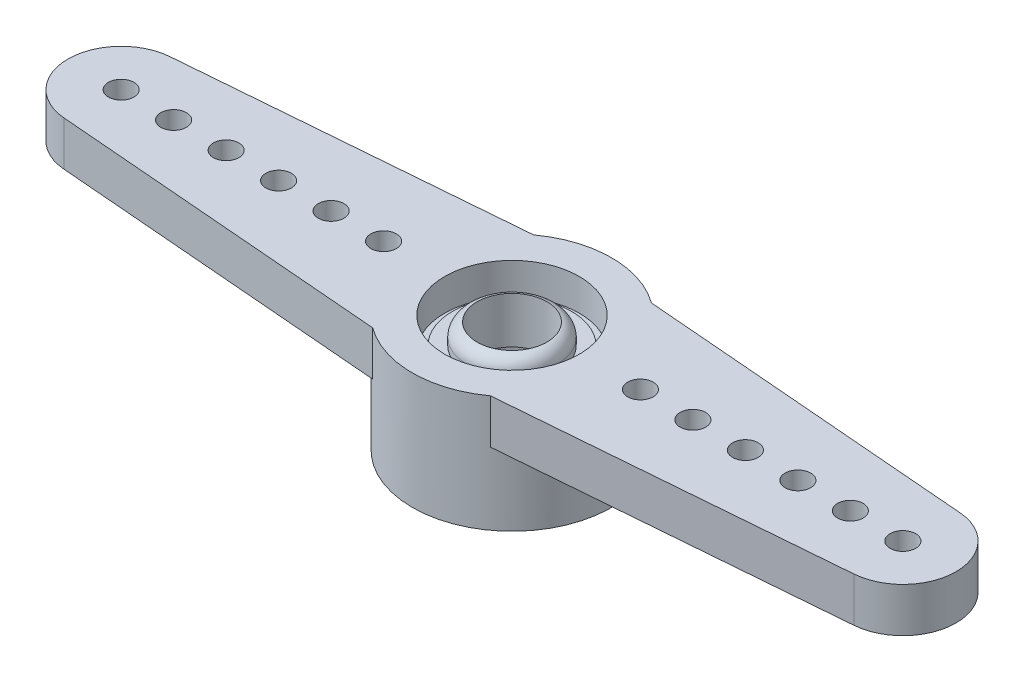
ISO-10303-21;
HEADER;
FILE_DESCRIPTION(('STEP AP214'),'2;1');
FILE_NAME('part.step','',(''),(''),'','','');
FILE_SCHEMA(('AUTOMOTIVE_DESIGN { 1 0 10303 214 1 1 1 1 }'));
ENDSEC;
DATA;
#1=APPLICATION_CONTEXT('core data for automotive mechanical design processes');
#2=APPLICATION_PROTOCOL_DEFINITION('international standard','automotive_design',2000,#1);
#3=PRODUCT_CONTEXT('',#1,'mechanical');
#4=PRODUCT('Part','Part','',(#3));
#5=PRODUCT_RELATED_PRODUCT_CATEGORY('part','',(#4));
#6=PRODUCT_DEFINITION_FORMATION('','',#4);
#7=PRODUCT_DEFINITION_CONTEXT('part definition',#1,'design');
#8=PRODUCT_DEFINITION('design','',#6,#7);
#9=PRODUCT_DEFINITION_SHAPE('','',#8);
#10=(LENGTH_UNIT() NAMED_UNIT(*) SI_UNIT(.MILLI.,.METRE.));
#11=(NAMED_UNIT(*) PLANE_ANGLE_UNIT() SI_UNIT($,.RADIAN.));
#12=(NAMED_UNIT(*) SI_UNIT($,.STERADIAN.) SOLID_ANGLE_UNIT());
#13=UNCERTAINTY_MEASURE_WITH_UNIT(LENGTH_MEASURE(1.E-05),#10,'distance_accuracy_value','');
#14=(GEOMETRIC_REPRESENTATION_CONTEXT(3) GLOBAL_UNCERTAINTY_ASSIGNED_CONTEXT((#13)) GLOBAL_UNIT_ASSIGNED_CONTEXT((#10,
#11,#12)) REPRESENTATION_CONTEXT('',''));
#15=CARTESIAN_POINT('',(0.,0.,0.));
#16=DIRECTION('',(0.,0.,1.));
#17=DIRECTION('',(1.,0.,0.));
#18=AXIS2_PLACEMENT_3D('',#15,#16,#17);
#19=CARTESIAN_POINT('',(0.,0.,0.));
#20=DIRECTION('',(0.,1.,0.));
#21=DIRECTION('',(0.,0.,1.));
#22=AXIS2_PLACEMENT_3D('',#19,#20,#21);
#23=PLANE('',#22);
#24=CARTESIAN_POINT('',(10.3759,0.,0.));
#25=DIRECTION('',(0.,1.,0.));
#26=DIRECTION('',(0.,0.,1.));
#27=AXIS2_PLACEMENT_3D('',#24,#25,#26);
#28=CIRCLE('',#27,0.46355);
#29=CARTESIAN_POINT('',(10.3759,0.,0.46355));
#30=VERTEX_POINT('',#29);
#31=EDGE_CURVE('E268',#30,#30,#28,.F.);
#32=ORIENTED_EDGE('',*,*,#31,.F.);
#33=EDGE_LOOP('',(#32));
#34=FACE_BOUND('',#33,.T.);
#35=CARTESIAN_POINT('',(6.5659,0.,0.));
#36=DIRECTION('',(0.,1.,0.));
#37=DIRECTION('',(0.,0.,1.));
#38=AXIS2_PLACEMENT_3D('',#35,#36,#37);
#39=CIRCLE('',#38,0.46355);
#40=CARTESIAN_POINT('',(6.5659,0.,0.46355));
#41=VERTEX_POINT('',#40);
#42=EDGE_CURVE('E282',#41,#41,#39,.F.);
#43=ORIENTED_EDGE('',*,*,#42,.F.);
#44=EDGE_LOOP('',(#43));
#45=FACE_BOUND('',#44,.T.);
#46=CARTESIAN_POINT('',(14.1859,0.,0.));
#47=DIRECTION('',(0.,1.,0.));
#48=DIRECTION('',(0.,0.,1.));
#49=AXIS2_PLACEMENT_3D('',#46,#47,#48);
#50=CIRCLE('',#49,0.46355);
#51=CARTESIAN_POINT('',(14.1859,0.,0.463550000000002));
#52=VERTEX_POINT('',#51);
#53=EDGE_CURVE('E292',#52,#52,#50,.F.);
#54=ORIENTED_EDGE('',*,*,#53,.F.);
#55=EDGE_LOOP('',(#54));
#56=FACE_BOUND('',#55,.T.);
#57=DIRECTION('',(0.996680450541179,0.,-0.0814130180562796));
#58=VECTOR('',#57,1.);
#59=CARTESIAN_POINT('',(14.3430596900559,0.,1.92399194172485));
#60=LINE('',#59,#58);
#61=CARTESIAN_POINT('',(2.1374141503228,0.,2.92099999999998));
#62=VERTEX_POINT('',#61);
#63=CARTESIAN_POINT('',(14.3430596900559,0.,1.92399194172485));
#64=VERTEX_POINT('',#63);
#65=EDGE_CURVE('E122',#62,#64,#60,.T.);
#66=ORIENTED_EDGE('',*,*,#65,.F.);
#67=CARTESIAN_POINT('',(0.,0.,0.));
#68=DIRECTION('',(0.,1.,0.));
#69=DIRECTION('',(0.,0.,1.));
#70=AXIS2_PLACEMENT_3D('',#67,#68,#69);
#71=CIRCLE('',#70,3.6195);
#72=CARTESIAN_POINT('',(2.1374141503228,0.,-2.92099999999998));
#73=VERTEX_POINT('',#72);
#74=EDGE_CURVE('E42',#62,#73,#71,.T.);
#75=ORIENTED_EDGE('',*,*,#74,.T.);
#76=DIRECTION('',(-0.996680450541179,0.,-0.0814130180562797));
#77=VECTOR('',#76,1.);
#78=CARTESIAN_POINT('',(14.3430596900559,0.,-1.92399194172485));
#79=LINE('',#78,#77);
#80=CARTESIAN_POINT('',(14.3430596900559,0.,-1.92399194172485));
#81=VERTEX_POINT('',#80);
#82=EDGE_CURVE('E127',#81,#73,#79,.T.);
#83=ORIENTED_EDGE('',*,*,#82,.F.);
#84=CARTESIAN_POINT('',(14.1859,0.,0.));
#85=DIRECTION('',(0.,1.,0.));
#86=DIRECTION('',(0.,0.,1.));
#87=AXIS2_PLACEMENT_3D('',#84,#85,#86);
#88=CIRCLE('',#87,1.93040000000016);
#89=EDGE_CURVE('E124',#64,#81,#88,.T.);
#90=ORIENTED_EDGE('',*,*,#89,.F.);
#91=EDGE_LOOP('',(#66,#75,#83,#90));
#92=FACE_BOUND('',#91,.T.);
#93=CARTESIAN_POINT('',(4.6609,0.,0.));
#94=DIRECTION('',(0.,1.,0.));
#95=DIRECTION('',(0.,0.,1.));
#96=AXIS2_PLACEMENT_3D('',#93,#94,#95);
#97=CIRCLE('',#96,0.46355);
#98=CARTESIAN_POINT('',(4.6609,0.,0.46355));
#99=VERTEX_POINT('',#98);
#100=EDGE_CURVE('E255',#99,#99,#97,.F.);
#101=ORIENTED_EDGE('',*,*,#100,.F.);
#102=EDGE_LOOP('',(#101));
#103=FACE_BOUND('',#102,.T.);
#104=CARTESIAN_POINT('',(8.4709,0.,0.));
#105=DIRECTION('',(0.,1.,0.));
#106=DIRECTION('',(0.,0.,1.));
#107=AXIS2_PLACEMENT_3D('',#104,#105,#106);
#108=CIRCLE('',#107,0.46355);
#109=CARTESIAN_POINT('',(8.4709,0.,0.46355));
#110=VERTEX_POINT('',#109);
#111=EDGE_CURVE('E259',#110,#110,#108,.F.);
#112=ORIENTED_EDGE('',*,*,#111,.F.);
#113=EDGE_LOOP('',(#112));
#114=FACE_BOUND('',#113,.T.);
#115=CARTESIAN_POINT('',(12.2809,0.,0.));
#116=DIRECTION('',(0.,1.,0.));
#117=DIRECTION('',(0.,0.,1.));
#118=AXIS2_PLACEMENT_3D('',#115,#116,#117);
#119=CIRCLE('',#118,0.46355);
#120=CARTESIAN_POINT('',(12.2809,0.,0.46355));
#121=VERTEX_POINT('',#120);
#122=EDGE_CURVE('E262',#121,#121,#119,.F.);
#123=ORIENTED_EDGE('',*,*,#122,.F.);
#124=EDGE_LOOP('',(#123));
#125=FACE_BOUND('',#124,.T.);
#126=ADVANCED_FACE('F32',(#34,#45,#56,#92,#103,#114,#125),#23,.F.);
#127=CARTESIAN_POINT('',(0.,1.6129,0.));
#128=DIRECTION('',(0.,1.,0.));
#129=DIRECTION('',(0.,0.,1.));
#130=AXIS2_PLACEMENT_3D('',#127,#128,#129);
#131=PLANE('',#130);
#132=CARTESIAN_POINT('',(10.3759,1.6129,0.));
#133=DIRECTION('',(0.,-1.,0.));
#134=DIRECTION('',(0.,0.,1.));
#135=AXIS2_PLACEMENT_3D('',#132,#133,#134);
#136=CIRCLE('',#135,0.46355);
#137=CARTESIAN_POINT('',(10.3759,1.6129,0.46355));
#138=VERTEX_POINT('',#137);
#139=EDGE_CURVE('E264',#138,#138,#136,.T.);
#140=ORIENTED_EDGE('',*,*,#139,.T.);
#141=EDGE_LOOP('',(#140));
#142=FACE_BOUND('',#141,.T.);
#143=CARTESIAN_POINT('',(6.5659,1.6129,0.));
#144=DIRECTION('',(0.,-1.,0.));
#145=DIRECTION('',(0.,0.,1.));
#146=AXIS2_PLACEMENT_3D('',#143,#144,#145);
#147=CIRCLE('',#146,0.46355);
#148=CARTESIAN_POINT('',(6.5659,1.6129,0.46355));
#149=VERTEX_POINT('',#148);
#150=EDGE_CURVE('E279',#149,#149,#147,.T.);
#151=ORIENTED_EDGE('',*,*,#150,.T.);
#152=EDGE_LOOP('',(#151));
#153=FACE_BOUND('',#152,.T.);
#154=CARTESIAN_POINT('',(14.1859,1.6129,0.));
#155=DIRECTION('',(0.,-1.,0.));
#156=DIRECTION('',(0.,0.,1.));
#157=AXIS2_PLACEMENT_3D('',#154,#155,#156);
#158=CIRCLE('',#157,0.46355);
#159=CARTESIAN_POINT('',(14.1859,1.6129,0.463550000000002));
#160=VERTEX_POINT('',#159);
#161=EDGE_CURVE('E289',#160,#160,#158,.T.);
#162=ORIENTED_EDGE('',*,*,#161,.T.);
#163=EDGE_LOOP('',(#162));
#164=FACE_BOUND('',#163,.T.);
#165=CARTESIAN_POINT('',(0.,1.6129,0.));
#166=DIRECTION('',(0.,1.,0.));
#167=DIRECTION('',(0.,0.,1.));
#168=AXIS2_PLACEMENT_3D('',#165,#166,#167);
#169=CIRCLE('',#168,2.44475);
#170=CARTESIAN_POINT('',(0.,1.6129,2.44475));
#171=VERTEX_POINT('',#170);
#172=EDGE_CURVE('E180',#171,#171,#169,.T.);
#173=ORIENTED_EDGE('',*,*,#172,.F.);
#174=EDGE_LOOP('',(#173));
#175=FACE_BOUND('',#174,.T.);
#176=CARTESIAN_POINT('',(-12.2809,1.6129,0.));
#177=DIRECTION('',(0.,1.,0.));
#178=DIRECTION('',(0.,0.,1.));
#179=AXIS2_PLACEMENT_3D('',#176,#177,#178);
#180=CIRCLE('',#179,0.46355);
#181=CARTESIAN_POINT('',(-12.2809,1.6129,0.46355));
#182=VERTEX_POINT('',#181);
#183=EDGE_CURVE('E177',#182,#182,#180,.T.);
#184=ORIENTED_EDGE('',*,*,#183,.F.);
#185=EDGE_LOOP('',(#184));
#186=FACE_BOUND('',#185,.T.);
#187=CARTESIAN_POINT('',(-10.3759,1.6129,0.));
#188=DIRECTION('',(0.,1.,0.));
#189=DIRECTION('',(0.,0.,1.));
#190=AXIS2_PLACEMENT_3D('',#187,#188,#189);
#191=CIRCLE('',#190,0.46355);
#192=CARTESIAN_POINT('',(-10.3759,1.6129,0.46355));
#193=VERTEX_POINT('',#192);
#194=EDGE_CURVE('E173',#193,#193,#191,.T.);
#195=ORIENTED_EDGE('',*,*,#194,.F.);
#196=EDGE_LOOP('',(#195));
#197=FACE_BOUND('',#196,.T.);
#198=CARTESIAN_POINT('',(-8.4709,1.6129,0.));
#199=DIRECTION('',(0.,1.,0.));
#200=DIRECTION('',(0.,0.,1.));
#201=AXIS2_PLACEMENT_3D('',#198,#199,#200);
#202=CIRCLE('',#201,0.46355);
#203=CARTESIAN_POINT('',(-8.4709,1.6129,0.46355));
#204=VERTEX_POINT('',#203);
#205=EDGE_CURVE('E169',#204,#204,#202,.T.);
#206=ORIENTED_EDGE('',*,*,#205,.F.);
#207=EDGE_LOOP('',(#206));
#208=FACE_BOUND('',#207,.T.);
#209=CARTESIAN_POINT('',(-6.5659,1.6129,0.));
#210=DIRECTION('',(0.,1.,0.));
#211=DIRECTION('',(0.,0.,1.));
#212=AXIS2_PLACEMENT_3D('',#209,#210,#211);
#213=CIRCLE('',#212,0.46355);
#214=CARTESIAN_POINT('',(-6.5659,1.6129,0.46355));
#215=VERTEX_POINT('',#214);
#216=EDGE_CURVE('E165',#215,#215,#213,.T.);
#217=ORIENTED_EDGE('',*,*,#216,.F.);
#218=EDGE_LOOP('',(#217));
#219=FACE_BOUND('',#218,.T.);
#220=CARTESIAN_POINT('',(-4.6609,1.6129,0.));
#221=DIRECTION('',(0.,1.,0.));
#222=DIRECTION('',(0.,0.,1.));
#223=AXIS2_PLACEMENT_3D('',#220,#221,#222);
#224=CIRCLE('',#223,0.46355);
#225=CARTESIAN_POINT('',(-4.6609,1.6129,0.46355));
#226=VERTEX_POINT('',#225);
#227=EDGE_CURVE('E161',#226,#226,#224,.T.);
#228=ORIENTED_EDGE('',*,*,#227,.F.);
#229=EDGE_LOOP('',(#228));
#230=FACE_BOUND('',#229,.T.);
#231=CARTESIAN_POINT('',(-14.1859,1.6129,0.));
#232=DIRECTION('',(0.,1.,0.));
#233=DIRECTION('',(0.,0.,1.));
#234=AXIS2_PLACEMENT_3D('',#231,#232,#233);
#235=CIRCLE('',#234,0.46355);
#236=CARTESIAN_POINT('',(-14.1859,1.6129,0.463550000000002));
#237=VERTEX_POINT('',#236);
#238=EDGE_CURVE('E157',#237,#237,#235,.T.);
#239=ORIENTED_EDGE('',*,*,#238,.F.);
#240=EDGE_LOOP('',(#239));
#241=FACE_BOUND('',#240,.T.);
#242=DIRECTION('',(0.996680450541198,0.,0.0814130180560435));
#243=VECTOR('',#242,1.);
#244=CARTESIAN_POINT('',(-14.3430596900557,1.6129,1.92399194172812));
#245=LINE('',#244,#243);
#246=CARTESIAN_POINT('',(-14.3430596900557,1.6129,1.92399194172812));
#247=VERTEX_POINT('',#246);
#248=CARTESIAN_POINT('',(-2.13741415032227,1.6129,2.92100000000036));
#249=VERTEX_POINT('',#248);
#250=EDGE_CURVE('E50',#247,#249,#245,.T.);
#251=ORIENTED_EDGE('',*,*,#250,.T.);
#252=CARTESIAN_POINT('',(0.,1.6129,0.));
#253=DIRECTION('',(0.,1.,0.));
#254=DIRECTION('',(0.,0.,1.));
#255=AXIS2_PLACEMENT_3D('',#252,#253,#254);
#256=CIRCLE('',#255,3.6195);
#257=CARTESIAN_POINT('',(2.1374141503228,1.6129,2.92099999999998));
#258=VERTEX_POINT('',#257);
#259=EDGE_CURVE('E135',#249,#258,#256,.T.);
#260=ORIENTED_EDGE('',*,*,#259,.T.);
#261=DIRECTION('',(0.996680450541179,0.,-0.0814130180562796));
#262=VECTOR('',#261,1.);
#263=CARTESIAN_POINT('',(14.3430596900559,1.6129,1.92399194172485));
#264=LINE('',#263,#262);
#265=CARTESIAN_POINT('',(14.3430596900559,1.6129,1.92399194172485));
#266=VERTEX_POINT('',#265);
#267=EDGE_CURVE('E87',#258,#266,#264,.T.);
#268=ORIENTED_EDGE('',*,*,#267,.T.);
#269=CARTESIAN_POINT('',(14.1859,1.6129,0.));
#270=DIRECTION('',(0.,1.,0.));
#271=DIRECTION('',(0.,0.,1.));
#272=AXIS2_PLACEMENT_3D('',#269,#270,#271);
#273=CIRCLE('',#272,1.93040000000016);
#274=CARTESIAN_POINT('',(14.3430596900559,1.6129,-1.92399194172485));
#275=VERTEX_POINT('',#274);
#276=EDGE_CURVE('E217',#266,#275,#273,.T.);
#277=ORIENTED_EDGE('',*,*,#276,.T.);
#278=DIRECTION('',(-0.996680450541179,0.,-0.0814130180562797));
#279=VECTOR('',#278,1.);
#280=CARTESIAN_POINT('',(14.3430596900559,1.6129,-1.92399194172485));
#281=LINE('',#280,#279);
#282=CARTESIAN_POINT('',(2.1374141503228,1.6129,-2.92099999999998));
#283=VERTEX_POINT('',#282);
#284=EDGE_CURVE('E219',#275,#283,#281,.T.);
#285=ORIENTED_EDGE('',*,*,#284,.T.);
#286=CARTESIAN_POINT('',(0.,1.6129,0.));
#287=DIRECTION('',(0.,1.,0.));
#288=DIRECTION('',(0.,0.,1.));
#289=AXIS2_PLACEMENT_3D('',#286,#287,#288);
#290=CIRCLE('',#289,3.6195);
#291=CARTESIAN_POINT('',(-2.13741415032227,1.6129,-2.92100000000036));
#292=VERTEX_POINT('',#291);
#293=EDGE_CURVE('E108',#283,#292,#290,.T.);
#294=ORIENTED_EDGE('',*,*,#293,.T.);
#295=DIRECTION('',(-0.996680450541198,0.,0.0814130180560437));
#296=VECTOR('',#295,1.);
#297=CARTESIAN_POINT('',(-14.3430596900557,1.6129,-1.92399194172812));
#298=LINE('',#297,#296);
#299=CARTESIAN_POINT('',(-14.3430596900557,1.6129,-1.92399194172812));
#300=VERTEX_POINT('',#299);
#301=EDGE_CURVE('E102',#292,#300,#298,.T.);
#302=ORIENTED_EDGE('',*,*,#301,.T.);
#303=CARTESIAN_POINT('',(-14.1859,1.6129,0.));
#304=DIRECTION('',(0.,1.,0.));
#305=DIRECTION('',(0.,0.,1.));
#306=AXIS2_PLACEMENT_3D('',#303,#304,#305);
#307=CIRCLE('',#306,1.9304000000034);
#308=EDGE_CURVE('E106',#300,#247,#307,.T.);
#309=ORIENTED_EDGE('',*,*,#308,.T.);
#310=EDGE_LOOP('',(#251,#260,#268,#277,#285,#294,#302,#309));
#311=FACE_BOUND('',#310,.T.);
#312=CARTESIAN_POINT('',(4.6609,1.6129,0.));
#313=DIRECTION('',(0.,-1.,0.));
#314=DIRECTION('',(0.,0.,1.));
#315=AXIS2_PLACEMENT_3D('',#312,#313,#314);
#316=CIRCLE('',#315,0.46355);
#317=CARTESIAN_POINT('',(4.6609,1.6129,0.46355));
#318=VERTEX_POINT('',#317);
#319=EDGE_CURVE('E285',#318,#318,#316,.T.);
#320=ORIENTED_EDGE('',*,*,#319,.T.);
#321=EDGE_LOOP('',(#320));
#322=FACE_BOUND('',#321,.T.);
#323=CARTESIAN_POINT('',(8.4709,1.6129,0.));
#324=DIRECTION('',(0.,-1.,0.));
#325=DIRECTION('',(0.,0.,1.));
#326=AXIS2_PLACEMENT_3D('',#323,#324,#325);
#327=CIRCLE('',#326,0.46355);
#328=CARTESIAN_POINT('',(8.4709,1.6129,0.46355));
#329=VERTEX_POINT('',#328);
#330=EDGE_CURVE('E275',#329,#329,#327,.T.);
#331=ORIENTED_EDGE('',*,*,#330,.T.);
#332=EDGE_LOOP('',(#331));
#333=FACE_BOUND('',#332,.T.);
#334=CARTESIAN_POINT('',(12.2809,1.6129,0.));
#335=DIRECTION('',(0.,-1.,0.));
#336=DIRECTION('',(0.,0.,1.));
#337=AXIS2_PLACEMENT_3D('',#334,#335,#336);
#338=CIRCLE('',#337,0.46355);
#339=CARTESIAN_POINT('',(12.2809,1.6129,0.46355));
#340=VERTEX_POINT('',#339);
#341=EDGE_CURVE('E265',#340,#340,#338,.T.);
#342=ORIENTED_EDGE('',*,*,#341,.T.);
#343=EDGE_LOOP('',(#342));
#344=FACE_BOUND('',#343,.T.);
#345=ADVANCED_FACE('F103',(#142,#153,#164,#175,#186,#197,#208,#219,#230,#241,#311,#322,#333,
#344),#131,.T.);
#346=CARTESIAN_POINT('',(0.,0.9144,0.));
#347=DIRECTION('',(0.,1.,0.));
#348=DIRECTION('',(0.,0.,1.));
#349=AXIS2_PLACEMENT_3D('',#346,#347,#348);
#350=TOROIDAL_SURFACE('',#349,1.143,0.508);
#351=CARTESIAN_POINT('',(0.,0.9144,0.));
#352=DIRECTION('',(0.,1.,0.));
#353=DIRECTION('',(0.,0.,1.));
#354=AXIS2_PLACEMENT_3D('',#351,#352,#353);
#355=CIRCLE('',#354,1.651);
#356=CARTESIAN_POINT('',(0.,0.9144,-1.651));
#357=VERTEX_POINT('',#356);
#358=EDGE_CURVE('E11',#357,#357,#355,.F.);
#359=ORIENTED_EDGE('',*,*,#358,.F.);
#360=EDGE_LOOP('',(#359));
#361=FACE_BOUND('',#360,.T.);
#362=CARTESIAN_POINT('',(0.,1.40626888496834,0.));
#363=DIRECTION('',(0.,-1.,0.));
#364=DIRECTION('',(0.,0.,-1.));
#365=AXIS2_PLACEMENT_3D('',#362,#363,#364);
#366=CIRCLE('',#365,1.27);
#367=CARTESIAN_POINT('',(0.,1.40626888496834,-1.27));
#368=VERTEX_POINT('',#367);
#369=EDGE_CURVE('E36',#368,#368,#366,.T.);
#370=ORIENTED_EDGE('',*,*,#369,.T.);
#371=EDGE_LOOP('',(#370));
#372=FACE_BOUND('',#371,.T.);
#373=ADVANCED_FACE('F34',(#361,#372),#350,.T.);
#374=CARTESIAN_POINT('',(0.,0.6604,0.));
#375=DIRECTION('',(0.,1.,0.));
#376=DIRECTION('',(0.,0.,1.));
#377=AXIS2_PLACEMENT_3D('',#374,#375,#376);
#378=PLANE('',#377);
#379=CARTESIAN_POINT('',(0.,0.6604,0.));
#380=DIRECTION('',(0.,1.,0.));
#381=DIRECTION('',(0.,0.,1.));
#382=AXIS2_PLACEMENT_3D('',#379,#380,#381);
#383=CIRCLE('',#382,2.159);
#384=CARTESIAN_POINT('',(0.,0.6604,2.159));
#385=VERTEX_POINT('',#384);
#386=EDGE_CURVE('E193',#385,#385,#383,.T.);
#387=ORIENTED_EDGE('',*,*,#386,.T.);
#388=EDGE_LOOP('',(#387));
#389=FACE_BOUND('',#388,.T.);
#390=CARTESIAN_POINT('',(0.,0.6604,0.));
#391=DIRECTION('',(0.,1.,0.));
#392=DIRECTION('',(0.,0.,1.));
#393=AXIS2_PLACEMENT_3D('',#390,#391,#392);
#394=CIRCLE('',#393,1.651);
#395=CARTESIAN_POINT('',(0.,0.6604,-1.651));
#396=VERTEX_POINT('',#395);
#397=EDGE_CURVE('E295',#396,#396,#394,.T.);
#398=ORIENTED_EDGE('',*,*,#397,.F.);
#399=EDGE_LOOP('',(#398));
#400=FACE_BOUND('',#399,.T.);
#401=ADVANCED_FACE('F308',(#389,#400),#378,.T.);
#402=CARTESIAN_POINT('',(0.,0.4572,0.));
#403=DIRECTION('',(0.,1.,0.));
#404=DIRECTION('',(0.,0.,1.));
#405=AXIS2_PLACEMENT_3D('',#402,#403,#404);
#406=PLANE('',#405);
#407=CARTESIAN_POINT('',(0.,0.4572,0.));
#408=DIRECTION('',(0.,1.,0.));
#409=DIRECTION('',(0.,0.,1.));
#410=AXIS2_PLACEMENT_3D('',#407,#408,#409);
#411=CIRCLE('',#410,2.44475);
#412=CARTESIAN_POINT('',(0.,0.4572,2.44475));
#413=VERTEX_POINT('',#412);
#414=EDGE_CURVE('E185',#413,#413,#411,.T.);
#415=ORIENTED_EDGE('',*,*,#414,.T.);
#416=EDGE_LOOP('',(#415));
#417=FACE_BOUND('',#416,.T.);
#418=CARTESIAN_POINT('',(0.,0.4572,0.));
#419=DIRECTION('',(0.,1.,0.));
#420=DIRECTION('',(0.,0.,1.));
#421=AXIS2_PLACEMENT_3D('',#418,#419,#420);
#422=CIRCLE('',#421,2.159);
#423=CARTESIAN_POINT('',(0.,0.4572,2.159));
#424=VERTEX_POINT('',#423);
#425=EDGE_CURVE('E196',#424,#424,#422,.T.);
#426=ORIENTED_EDGE('',*,*,#425,.F.);
#427=EDGE_LOOP('',(#426));
#428=FACE_BOUND('',#427,.T.);
#429=ADVANCED_FACE('F305',(#417,#428),#406,.T.);
#430=CARTESIAN_POINT('',(0.,-2.6162,0.));
#431=DIRECTION('',(0.,1.,0.));
#432=DIRECTION('',(0.,0.,1.));
#433=AXIS2_PLACEMENT_3D('',#430,#431,#432);
#434=CYLINDRICAL_SURFACE('',#433,1.27);
#435=CARTESIAN_POINT('',(0.,-0.2794,0.));
#436=DIRECTION('',(0.,-1.,0.));
#437=DIRECTION('',(0.,0.,-1.));
#438=AXIS2_PLACEMENT_3D('',#435,#436,#437);
#439=CIRCLE('',#438,1.27);
#440=CARTESIAN_POINT('',(0.,-0.2794,-1.27));
#441=VERTEX_POINT('',#440);
#442=EDGE_CURVE('E178',#441,#441,#439,.F.);
#443=ORIENTED_EDGE('',*,*,#442,.F.);
#444=EDGE_LOOP('',(#443));
#445=FACE_BOUND('',#444,.T.);
#446=ORIENTED_EDGE('',*,*,#369,.F.);
#447=EDGE_LOOP('',(#446));
#448=FACE_BOUND('',#447,.T.);
#449=ADVANCED_FACE('F307',(#445,#448),#434,.F.);
#450=CARTESIAN_POINT('',(14.3430596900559,1.6129,1.92399194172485));
#451=DIRECTION('',(-0.0814130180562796,0.,-0.996680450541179));
#452=DIRECTION('',(-0.996680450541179,0.,0.0814130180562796));
#453=AXIS2_PLACEMENT_3D('',#450,#451,#452);
#454=PLANE('',#453);
#455=ORIENTED_EDGE('',*,*,#65,.T.);
#456=DIRECTION('',(0.,-1.,0.));
#457=VECTOR('',#456,1.);
#458=CARTESIAN_POINT('',(14.3430596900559,1.6129,1.92399194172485));
#459=LINE('',#458,#457);
#460=EDGE_CURVE('E146',#266,#64,#459,.T.);
#461=ORIENTED_EDGE('',*,*,#460,.F.);
#462=ORIENTED_EDGE('',*,*,#267,.F.);
#463=DIRECTION('',(0.,-1.,0.));
#464=VECTOR('',#463,1.);
#465=CARTESIAN_POINT('',(2.1374141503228,1.6129,2.92099999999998));
#466=LINE('',#465,#464);
#467=EDGE_CURVE('E149',#258,#62,#466,.T.);
#468=ORIENTED_EDGE('',*,*,#467,.T.);
#469=EDGE_LOOP('',(#455,#461,#462,#468));
#470=FACE_BOUND('',#469,.T.);
#471=ADVANCED_FACE('F241',(#470),#454,.F.);
#472=CARTESIAN_POINT('',(14.1859,1.6129,0.));
#473=DIRECTION('',(0.,-1.,0.));
#474=DIRECTION('',(0.,0.,-1.));
#475=AXIS2_PLACEMENT_3D('',#472,#473,#474);
#476=CYLINDRICAL_SURFACE('',#475,1.93040000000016);
#477=ORIENTED_EDGE('',*,*,#89,.T.);
#478=DIRECTION('',(0.,-1.,0.));
#479=VECTOR('',#478,1.);
#480=CARTESIAN_POINT('',(14.3430596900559,1.6129,-1.92399194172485));
#481=LINE('',#480,#479);
#482=EDGE_CURVE('E143',#275,#81,#481,.T.);
#483=ORIENTED_EDGE('',*,*,#482,.F.);
#484=ORIENTED_EDGE('',*,*,#276,.F.);
#485=ORIENTED_EDGE('',*,*,#460,.T.);
#486=EDGE_LOOP('',(#477,#483,#484,#485));
#487=FACE_BOUND('',#486,.T.);
#488=ADVANCED_FACE('F245',(#487),#476,.T.);
#489=CARTESIAN_POINT('',(14.3430596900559,1.6129,-1.92399194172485));
#490=DIRECTION('',(-0.0814130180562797,0.,0.996680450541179));
#491=DIRECTION('',(0.996680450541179,0.,0.0814130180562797));
#492=AXIS2_PLACEMENT_3D('',#489,#490,#491);
#493=PLANE('',#492);
#494=ORIENTED_EDGE('',*,*,#82,.T.);
#495=DIRECTION('',(0.,-1.,0.));
#496=VECTOR('',#495,1.);
#497=CARTESIAN_POINT('',(2.1374141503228,1.6129,-2.92099999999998));
#498=LINE('',#497,#496);
#499=EDGE_CURVE('E140',#283,#73,#498,.T.);
#500=ORIENTED_EDGE('',*,*,#499,.F.);
#501=ORIENTED_EDGE('',*,*,#284,.F.);
#502=ORIENTED_EDGE('',*,*,#482,.T.);
#503=EDGE_LOOP('',(#494,#500,#501,#502));
#504=FACE_BOUND('',#503,.T.);
#505=ADVANCED_FACE('F225',(#504),#493,.F.);
#506=CARTESIAN_POINT('',(0.,1.6129,0.));
#507=DIRECTION('',(0.,-1.,0.));
#508=DIRECTION('',(0.,0.,-1.));
#509=AXIS2_PLACEMENT_3D('',#506,#507,#508);
#510=CYLINDRICAL_SURFACE('',#509,3.6195);
#511=ORIENTED_EDGE('',*,*,#499,.T.);
#512=ORIENTED_EDGE('',*,*,#74,.F.);
#513=ORIENTED_EDGE('',*,*,#467,.F.);
#514=ORIENTED_EDGE('',*,*,#259,.F.);
#515=DIRECTION('',(0.,-1.,0.));
#516=VECTOR('',#515,1.);
#517=CARTESIAN_POINT('',(-2.13741415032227,1.6129,2.92100000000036));
#518=LINE('',#517,#516);
#519=CARTESIAN_POINT('',(-2.13741415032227,0.,2.92100000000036));
#520=VERTEX_POINT('',#519);
#521=EDGE_CURVE('E118',#249,#520,#518,.T.);
#522=ORIENTED_EDGE('',*,*,#521,.T.);
#523=CARTESIAN_POINT('',(-2.13741415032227,0.,-2.92100000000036));
#524=VERTEX_POINT('',#523);
#525=EDGE_CURVE('E151',#524,#520,#71,.T.);
#526=ORIENTED_EDGE('',*,*,#525,.F.);
#527=DIRECTION('',(0.,-1.,0.));
#528=VECTOR('',#527,1.);
#529=CARTESIAN_POINT('',(-2.13741415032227,1.6129,-2.92100000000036));
#530=LINE('',#529,#528);
#531=EDGE_CURVE('E113',#292,#524,#530,.T.);
#532=ORIENTED_EDGE('',*,*,#531,.F.);
#533=ORIENTED_EDGE('',*,*,#293,.F.);
#534=EDGE_LOOP('',(#511,#512,#513,#514,#522,#526,#532,#533));
#535=FACE_BOUND('',#534,.T.);
#536=CARTESIAN_POINT('',(0.,-2.6162,0.));
#537=DIRECTION('',(0.,1.,0.));
#538=DIRECTION('',(0.,0.,1.));
#539=AXIS2_PLACEMENT_3D('',#536,#537,#538);
#540=CIRCLE('',#539,3.6195);
#541=CARTESIAN_POINT('',(0.,-2.6162,3.6195));
#542=VERTEX_POINT('',#541);
#543=EDGE_CURVE('E125',#542,#542,#540,.T.);
#544=ORIENTED_EDGE('',*,*,#543,.T.);
#545=EDGE_LOOP('',(#544));
#546=FACE_BOUND('',#545,.T.);
#547=ADVANCED_FACE('F228',(#535,#546),#510,.T.);
#548=CARTESIAN_POINT('',(-14.3430596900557,1.6129,-1.92399194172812));
#549=DIRECTION('',(0.0814130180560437,0.,0.996680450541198));
#550=DIRECTION('',(0.996680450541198,0.,-0.0814130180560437));
#551=AXIS2_PLACEMENT_3D('',#548,#549,#550);
#552=PLANE('',#551);
#553=DIRECTION('',(-0.996680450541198,0.,0.0814130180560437));
#554=VECTOR('',#553,1.);
#555=CARTESIAN_POINT('',(-14.3430596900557,0.,-1.92399194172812));
#556=LINE('',#555,#554);
#557=CARTESIAN_POINT('',(-14.3430596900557,0.,-1.92399194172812));
#558=VERTEX_POINT('',#557);
#559=EDGE_CURVE('E71',#524,#558,#556,.T.);
#560=ORIENTED_EDGE('',*,*,#559,.T.);
#561=DIRECTION('',(0.,-1.,0.));
#562=VECTOR('',#561,1.);
#563=CARTESIAN_POINT('',(-14.3430596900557,1.6129,-1.92399194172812));
#564=LINE('',#563,#562);
#565=EDGE_CURVE('E111',#300,#558,#564,.T.);
#566=ORIENTED_EDGE('',*,*,#565,.F.);
#567=ORIENTED_EDGE('',*,*,#301,.F.);
#568=ORIENTED_EDGE('',*,*,#531,.T.);
#569=EDGE_LOOP('',(#560,#566,#567,#568));
#570=FACE_BOUND('',#569,.T.);
#571=ADVANCED_FACE('F112',(#570),#552,.F.);
#572=CARTESIAN_POINT('',(-14.1859,1.6129,0.));
#573=DIRECTION('',(0.,-1.,0.));
#574=DIRECTION('',(0.,0.,-1.));
#575=AXIS2_PLACEMENT_3D('',#572,#573,#574);
#576=CYLINDRICAL_SURFACE('',#575,1.9304000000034);
#577=CARTESIAN_POINT('',(-14.1859,0.,0.));
#578=DIRECTION('',(0.,1.,0.));
#579=DIRECTION('',(0.,0.,1.));
#580=AXIS2_PLACEMENT_3D('',#577,#578,#579);
#581=CIRCLE('',#580,1.9304000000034);
#582=CARTESIAN_POINT('',(-14.3430596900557,0.,1.92399194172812));
#583=VERTEX_POINT('',#582);
#584=EDGE_CURVE('E78',#558,#583,#581,.T.);
#585=ORIENTED_EDGE('',*,*,#584,.T.);
#586=DIRECTION('',(0.,-1.,0.));
#587=VECTOR('',#586,1.);
#588=CARTESIAN_POINT('',(-14.3430596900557,1.6129,1.92399194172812));
#589=LINE('',#588,#587);
#590=EDGE_CURVE('E114',#247,#583,#589,.T.);
#591=ORIENTED_EDGE('',*,*,#590,.F.);
#592=ORIENTED_EDGE('',*,*,#308,.F.);
#593=ORIENTED_EDGE('',*,*,#565,.T.);
#594=EDGE_LOOP('',(#585,#591,#592,#593));
#595=FACE_BOUND('',#594,.T.);
#596=ADVANCED_FACE('F116',(#595),#576,.T.);
#597=CARTESIAN_POINT('',(-14.3430596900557,1.6129,1.92399194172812));
#598=DIRECTION('',(0.0814130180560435,0.,-0.996680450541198));
#599=DIRECTION('',(-0.996680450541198,0.,-0.0814130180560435));
#600=AXIS2_PLACEMENT_3D('',#597,#598,#599);
#601=PLANE('',#600);
#602=DIRECTION('',(0.996680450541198,0.,0.0814130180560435));
#603=VECTOR('',#602,1.);
#604=CARTESIAN_POINT('',(-14.3430596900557,0.,1.92399194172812));
#605=LINE('',#604,#603);
#606=EDGE_CURVE('E132',#583,#520,#605,.T.);
#607=ORIENTED_EDGE('',*,*,#606,.T.);
#608=ORIENTED_EDGE('',*,*,#521,.F.);
#609=ORIENTED_EDGE('',*,*,#250,.F.);
#610=ORIENTED_EDGE('',*,*,#590,.T.);
#611=EDGE_LOOP('',(#607,#608,#609,#610));
#612=FACE_BOUND('',#611,.T.);
#613=ADVANCED_FACE('F237',(#612),#601,.F.);
#614=CARTESIAN_POINT('',(-12.2809,0.,0.));
#615=DIRECTION('',(0.,1.,0.));
#616=DIRECTION('',(0.,0.,1.));
#617=AXIS2_PLACEMENT_3D('',#614,#615,#616);
#618=CIRCLE('',#617,0.46355);
#619=CARTESIAN_POINT('',(-12.2809,0.,0.46355));
#620=VERTEX_POINT('',#619);
#621=EDGE_CURVE('E174',#620,#620,#618,.T.);
#622=ORIENTED_EDGE('',*,*,#621,.T.);
#623=EDGE_LOOP('',(#622));
#624=FACE_BOUND('',#623,.T.);
#625=CARTESIAN_POINT('',(-10.3759,0.,0.));
#626=DIRECTION('',(0.,1.,0.));
#627=DIRECTION('',(0.,0.,1.));
#628=AXIS2_PLACEMENT_3D('',#625,#626,#627);
#629=CIRCLE('',#628,0.46355);
#630=CARTESIAN_POINT('',(-10.3759,0.,0.46355));
#631=VERTEX_POINT('',#630);
#632=EDGE_CURVE('E170',#631,#631,#629,.T.);
#633=ORIENTED_EDGE('',*,*,#632,.T.);
#634=EDGE_LOOP('',(#633));
#635=FACE_BOUND('',#634,.T.);
#636=CARTESIAN_POINT('',(-8.4709,0.,0.));
#637=DIRECTION('',(0.,1.,0.));
#638=DIRECTION('',(0.,0.,1.));
#639=AXIS2_PLACEMENT_3D('',#636,#637,#638);
#640=CIRCLE('',#639,0.46355);
#641=CARTESIAN_POINT('',(-8.4709,0.,0.46355));
#642=VERTEX_POINT('',#641);
#643=EDGE_CURVE('E166',#642,#642,#640,.T.);
#644=ORIENTED_EDGE('',*,*,#643,.T.);
#645=EDGE_LOOP('',(#644));
#646=FACE_BOUND('',#645,.T.);
#647=CARTESIAN_POINT('',(-6.5659,0.,0.));
#648=DIRECTION('',(0.,1.,0.));
#649=DIRECTION('',(0.,0.,1.));
#650=AXIS2_PLACEMENT_3D('',#647,#648,#649);
#651=CIRCLE('',#650,0.46355);
#652=CARTESIAN_POINT('',(-6.5659,0.,0.46355));
#653=VERTEX_POINT('',#652);
#654=EDGE_CURVE('E162',#653,#653,#651,.T.);
#655=ORIENTED_EDGE('',*,*,#654,.T.);
#656=EDGE_LOOP('',(#655));
#657=FACE_BOUND('',#656,.T.);
#658=CARTESIAN_POINT('',(-4.6609,0.,0.));
#659=DIRECTION('',(0.,1.,0.));
#660=DIRECTION('',(0.,0.,1.));
#661=AXIS2_PLACEMENT_3D('',#658,#659,#660);
#662=CIRCLE('',#661,0.46355);
#663=CARTESIAN_POINT('',(-4.6609,0.,0.46355));
#664=VERTEX_POINT('',#663);
#665=EDGE_CURVE('E158',#664,#664,#662,.T.);
#666=ORIENTED_EDGE('',*,*,#665,.T.);
#667=EDGE_LOOP('',(#666));
#668=FACE_BOUND('',#667,.T.);
#669=CARTESIAN_POINT('',(-14.1859,0.,0.));
#670=DIRECTION('',(0.,1.,0.));
#671=DIRECTION('',(0.,0.,1.));
#672=AXIS2_PLACEMENT_3D('',#669,#670,#671);
#673=CIRCLE('',#672,0.46355);
#674=CARTESIAN_POINT('',(-14.1859,0.,0.463550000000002));
#675=VERTEX_POINT('',#674);
#676=EDGE_CURVE('E154',#675,#675,#673,.T.);
#677=ORIENTED_EDGE('',*,*,#676,.T.);
#678=EDGE_LOOP('',(#677));
#679=FACE_BOUND('',#678,.T.);
#680=ORIENTED_EDGE('',*,*,#559,.F.);
#681=ORIENTED_EDGE('',*,*,#525,.T.);
#682=ORIENTED_EDGE('',*,*,#606,.F.);
#683=ORIENTED_EDGE('',*,*,#584,.F.);
#684=EDGE_LOOP('',(#680,#681,#682,#683));
#685=FACE_BOUND('',#684,.T.);
#686=ADVANCED_FACE('F234',(#624,#635,#646,#657,#668,#679,#685),#23,.F.);
#687=CARTESIAN_POINT('',(0.,-2.6162,0.));
#688=DIRECTION('',(0.,1.,0.));
#689=DIRECTION('',(0.,0.,1.));
#690=AXIS2_PLACEMENT_3D('',#687,#688,#689);
#691=PLANE('',#690);
#692=CARTESIAN_POINT('',(0.,-2.6162,0.));
#693=DIRECTION('',(0.,-1.,0.));
#694=DIRECTION('',(0.,0.,-1.));
#695=AXIS2_PLACEMENT_3D('',#692,#693,#694);
#696=CIRCLE('',#695,2.286);
#697=CARTESIAN_POINT('',(0.,-2.6162,-2.286));
#698=VERTEX_POINT('',#697);
#699=EDGE_CURVE('E188',#698,#698,#696,.T.);
#700=ORIENTED_EDGE('',*,*,#699,.F.);
#701=EDGE_LOOP('',(#700));
#702=FACE_BOUND('',#701,.T.);
#703=ORIENTED_EDGE('',*,*,#543,.F.);
#704=EDGE_LOOP('',(#703));
#705=FACE_BOUND('',#704,.T.);
#706=ADVANCED_FACE('F350',(#702,#705),#691,.F.);
#707=CARTESIAN_POINT('',(-14.1859,-2.6162,0.));
#708=DIRECTION('',(0.,1.,0.));
#709=DIRECTION('',(0.,0.,1.));
#710=AXIS2_PLACEMENT_3D('',#707,#708,#709);
#711=CYLINDRICAL_SURFACE('',#710,0.46355);
#712=ORIENTED_EDGE('',*,*,#238,.T.);
#713=EDGE_LOOP('',(#712));
#714=FACE_BOUND('',#713,.T.);
#715=ORIENTED_EDGE('',*,*,#676,.F.);
#716=EDGE_LOOP('',(#715));
#717=FACE_BOUND('',#716,.T.);
#718=ADVANCED_FACE('F345',(#714,#717),#711,.F.);
#719=CARTESIAN_POINT('',(-4.6609,-2.6162,0.));
#720=DIRECTION('',(0.,1.,0.));
#721=DIRECTION('',(0.,0.,1.));
#722=AXIS2_PLACEMENT_3D('',#719,#720,#721);
#723=CYLINDRICAL_SURFACE('',#722,0.46355);
#724=ORIENTED_EDGE('',*,*,#227,.T.);
#725=EDGE_LOOP('',(#724));
#726=FACE_BOUND('',#725,.T.);
#727=ORIENTED_EDGE('',*,*,#665,.F.);
#728=EDGE_LOOP('',(#727));
#729=FACE_BOUND('',#728,.T.);
#730=ADVANCED_FACE('F342',(#726,#729),#723,.F.);
#731=CARTESIAN_POINT('',(-6.5659,-2.6162,0.));
#732=DIRECTION('',(0.,1.,0.));
#733=DIRECTION('',(0.,0.,1.));
#734=AXIS2_PLACEMENT_3D('',#731,#732,#733);
#735=CYLINDRICAL_SURFACE('',#734,0.46355);
#736=ORIENTED_EDGE('',*,*,#216,.T.);
#737=EDGE_LOOP('',(#736));
#738=FACE_BOUND('',#737,.T.);
#739=ORIENTED_EDGE('',*,*,#654,.F.);
#740=EDGE_LOOP('',(#739));
#741=FACE_BOUND('',#740,.T.);
#742=ADVANCED_FACE('F338',(#738,#741),#735,.F.);
#743=CARTESIAN_POINT('',(-8.4709,-2.6162,0.));
#744=DIRECTION('',(0.,1.,0.));
#745=DIRECTION('',(0.,0.,1.));
#746=AXIS2_PLACEMENT_3D('',#743,#744,#745);
#747=CYLINDRICAL_SURFACE('',#746,0.46355);
#748=ORIENTED_EDGE('',*,*,#205,.T.);
#749=EDGE_LOOP('',(#748));
#750=FACE_BOUND('',#749,.T.);
#751=ORIENTED_EDGE('',*,*,#643,.F.);
#752=EDGE_LOOP('',(#751));
#753=FACE_BOUND('',#752,.T.);
#754=ADVANCED_FACE('F334',(#750,#753),#747,.F.);
#755=CARTESIAN_POINT('',(-10.3759,-2.6162,0.));
#756=DIRECTION('',(0.,1.,0.));
#757=DIRECTION('',(0.,0.,1.));
#758=AXIS2_PLACEMENT_3D('',#755,#756,#757);
#759=CYLINDRICAL_SURFACE('',#758,0.46355);
#760=ORIENTED_EDGE('',*,*,#194,.T.);
#761=EDGE_LOOP('',(#760));
#762=FACE_BOUND('',#761,.T.);
#763=ORIENTED_EDGE('',*,*,#632,.F.);
#764=EDGE_LOOP('',(#763));
#765=FACE_BOUND('',#764,.T.);
#766=ADVANCED_FACE('F330',(#762,#765),#759,.F.);
#767=CARTESIAN_POINT('',(-12.2809,-2.6162,0.));
#768=DIRECTION('',(0.,1.,0.));
#769=DIRECTION('',(0.,0.,1.));
#770=AXIS2_PLACEMENT_3D('',#767,#768,#769);
#771=CYLINDRICAL_SURFACE('',#770,0.46355);
#772=ORIENTED_EDGE('',*,*,#183,.T.);
#773=EDGE_LOOP('',(#772));
#774=FACE_BOUND('',#773,.T.);
#775=ORIENTED_EDGE('',*,*,#621,.F.);
#776=EDGE_LOOP('',(#775));
#777=FACE_BOUND('',#776,.T.);
#778=ADVANCED_FACE('F326',(#774,#777),#771,.F.);
#779=CARTESIAN_POINT('',(0.,0.4572,0.));
#780=DIRECTION('',(0.,1.,0.));
#781=DIRECTION('',(0.,0.,1.));
#782=AXIS2_PLACEMENT_3D('',#779,#780,#781);
#783=CYLINDRICAL_SURFACE('',#782,2.44475);
#784=ORIENTED_EDGE('',*,*,#414,.F.);
#785=EDGE_LOOP('',(#784));
#786=FACE_BOUND('',#785,.T.);
#787=ORIENTED_EDGE('',*,*,#172,.T.);
#788=EDGE_LOOP('',(#787));
#789=FACE_BOUND('',#788,.T.);
#790=ADVANCED_FACE('F322',(#786,#789),#783,.F.);
#791=CARTESIAN_POINT('',(0.,-0.2794,0.));
#792=DIRECTION('',(0.,-1.,0.));
#793=DIRECTION('',(0.,0.,-1.));
#794=AXIS2_PLACEMENT_3D('',#791,#792,#793);
#795=PLANE('',#794);
#796=CARTESIAN_POINT('',(0.,-0.2794,0.));
#797=DIRECTION('',(0.,-1.,0.));
#798=DIRECTION('',(0.,0.,-1.));
#799=AXIS2_PLACEMENT_3D('',#796,#797,#798);
#800=CIRCLE('',#799,2.286);
#801=CARTESIAN_POINT('',(0.,-0.2794,-2.286));
#802=VERTEX_POINT('',#801);
#803=EDGE_CURVE('E181',#802,#802,#800,.T.);
#804=ORIENTED_EDGE('',*,*,#803,.T.);
#805=EDGE_LOOP('',(#804));
#806=FACE_BOUND('',#805,.T.);
#807=ORIENTED_EDGE('',*,*,#442,.T.);
#808=EDGE_LOOP('',(#807));
#809=FACE_BOUND('',#808,.T.);
#810=ADVANCED_FACE('F325',(#806,#809),#795,.T.);
#811=CARTESIAN_POINT('',(0.,-0.2794,0.));
#812=DIRECTION('',(0.,-1.,0.));
#813=DIRECTION('',(0.,0.,-1.));
#814=AXIS2_PLACEMENT_3D('',#811,#812,#813);
#815=CYLINDRICAL_SURFACE('',#814,2.286);
#816=ORIENTED_EDGE('',*,*,#803,.F.);
#817=EDGE_LOOP('',(#816));
#818=FACE_BOUND('',#817,.T.);
#819=ORIENTED_EDGE('',*,*,#699,.T.);
#820=EDGE_LOOP('',(#819));
#821=FACE_BOUND('',#820,.T.);
#822=ADVANCED_FACE('F320',(#818,#821),#815,.F.);
#823=CARTESIAN_POINT('',(0.,0.6604,0.));
#824=DIRECTION('',(0.,-1.,0.));
#825=DIRECTION('',(0.,0.,-1.));
#826=AXIS2_PLACEMENT_3D('',#823,#824,#825);
#827=CYLINDRICAL_SURFACE('',#826,2.159);
#828=ORIENTED_EDGE('',*,*,#386,.F.);
#829=EDGE_LOOP('',(#828));
#830=FACE_BOUND('',#829,.T.);
#831=ORIENTED_EDGE('',*,*,#425,.T.);
#832=EDGE_LOOP('',(#831));
#833=FACE_BOUND('',#832,.T.);
#834=ADVANCED_FACE('F303',(#830,#833),#827,.T.);
#835=CARTESIAN_POINT('',(0.,1.4224,0.));
#836=DIRECTION('',(0.,-1.,0.));
#837=DIRECTION('',(0.,0.,-1.));
#838=AXIS2_PLACEMENT_3D('',#835,#836,#837);
#839=CYLINDRICAL_SURFACE('',#838,1.651);
#840=CARTESIAN_POINT('',(0.,0.9144,-1.651));
#841=CARTESIAN_POINT('',(0.,0.911754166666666,-1.651));
#842=CARTESIAN_POINT('',(0.,0.909108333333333,-1.651));
#843=CARTESIAN_POINT('',(0.,0.903816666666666,-1.651));
#844=CARTESIAN_POINT('',(0.,0.901170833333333,-1.651));
#845=CARTESIAN_POINT('',(0.,0.895879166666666,-1.651));
#846=CARTESIAN_POINT('',(0.,0.893233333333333,-1.651));
#847=CARTESIAN_POINT('',(0.,0.887941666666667,-1.651));
#848=CARTESIAN_POINT('',(0.,0.885295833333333,-1.651));
#849=CARTESIAN_POINT('',(0.,0.880004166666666,-1.651));
#850=CARTESIAN_POINT('',(0.,0.877358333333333,-1.651));
#851=CARTESIAN_POINT('',(0.,0.872066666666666,-1.651));
#852=CARTESIAN_POINT('',(0.,0.869420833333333,-1.651));
#853=CARTESIAN_POINT('',(0.,0.864129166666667,-1.651));
#854=CARTESIAN_POINT('',(0.,0.861483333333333,-1.651));
#855=CARTESIAN_POINT('',(0.,0.856191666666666,-1.651));
#856=CARTESIAN_POINT('',(0.,0.853545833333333,-1.651));
#857=CARTESIAN_POINT('',(0.,0.848254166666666,-1.651));
#858=CARTESIAN_POINT('',(0.,0.845608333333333,-1.651));
#859=CARTESIAN_POINT('',(0.,0.840316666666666,-1.651));
#860=CARTESIAN_POINT('',(0.,0.837670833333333,-1.651));
#861=CARTESIAN_POINT('',(0.,0.832379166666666,-1.651));
#862=CARTESIAN_POINT('',(0.,0.829733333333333,-1.651));
#863=CARTESIAN_POINT('',(0.,0.824441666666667,-1.651));
#864=CARTESIAN_POINT('',(0.,0.821795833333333,-1.651));
#865=CARTESIAN_POINT('',(0.,0.816504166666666,-1.651));
#866=CARTESIAN_POINT('',(0.,0.813858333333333,-1.651));
#867=CARTESIAN_POINT('',(0.,0.808566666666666,-1.651));
#868=CARTESIAN_POINT('',(0.,0.805920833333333,-1.651));
#869=CARTESIAN_POINT('',(0.,0.800629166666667,-1.651));
#870=CARTESIAN_POINT('',(0.,0.797983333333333,-1.651));
#871=CARTESIAN_POINT('',(0.,0.792691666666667,-1.651));
#872=CARTESIAN_POINT('',(0.,0.790045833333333,-1.651));
#873=CARTESIAN_POINT('',(0.,0.784754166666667,-1.651));
#874=CARTESIAN_POINT('',(0.,0.782108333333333,-1.651));
#875=CARTESIAN_POINT('',(0.,0.776816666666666,-1.651));
#876=CARTESIAN_POINT('',(0.,0.774170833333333,-1.651));
#877=CARTESIAN_POINT('',(0.,0.768879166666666,-1.651));
#878=CARTESIAN_POINT('',(0.,0.766233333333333,-1.651));
#879=CARTESIAN_POINT('',(0.,0.760941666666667,-1.651));
#880=CARTESIAN_POINT('',(0.,0.758295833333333,-1.651));
#881=CARTESIAN_POINT('',(0.,0.753004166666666,-1.651));
#882=CARTESIAN_POINT('',(0.,0.750358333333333,-1.651));
#883=CARTESIAN_POINT('',(0.,0.745066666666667,-1.651));
#884=CARTESIAN_POINT('',(0.,0.742420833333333,-1.651));
#885=CARTESIAN_POINT('',(0.,0.737129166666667,-1.651));
#886=CARTESIAN_POINT('',(0.,0.734483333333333,-1.651));
#887=CARTESIAN_POINT('',(0.,0.729191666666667,-1.651));
#888=CARTESIAN_POINT('',(0.,0.726545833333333,-1.651));
#889=CARTESIAN_POINT('',(0.,0.721254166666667,-1.651));
#890=CARTESIAN_POINT('',(0.,0.718608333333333,-1.651));
#891=CARTESIAN_POINT('',(0.,0.713316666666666,-1.651));
#892=CARTESIAN_POINT('',(0.,0.710670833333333,-1.651));
#893=CARTESIAN_POINT('',(0.,0.705379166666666,-1.651));
#894=CARTESIAN_POINT('',(0.,0.702733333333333,-1.651));
#895=CARTESIAN_POINT('',(0.,0.697441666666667,-1.651));
#896=CARTESIAN_POINT('',(0.,0.694795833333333,-1.651));
#897=CARTESIAN_POINT('',(0.,0.689504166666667,-1.651));
#898=CARTESIAN_POINT('',(0.,0.686858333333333,-1.651));
#899=CARTESIAN_POINT('',(0.,0.681566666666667,-1.651));
#900=CARTESIAN_POINT('',(0.,0.678920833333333,-1.651));
#901=CARTESIAN_POINT('',(0.,0.673629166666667,-1.651));
#902=CARTESIAN_POINT('',(0.,0.670983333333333,-1.651));
#903=CARTESIAN_POINT('',(0.,0.665691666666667,-1.651));
#904=CARTESIAN_POINT('',(0.,0.663045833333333,-1.651));
#905=CARTESIAN_POINT('',(0.,0.6604,-1.651));
#906=B_SPLINE_CURVE_WITH_KNOTS('',3,(#840,#841,#842,#843,#844,#845,#846,#847,#848,#849,#850,
#851,#852,#853,#854,#855,#856,#857,#858,#859,#860,#861,#862,#863,#864,#865,#866,#867,#868,#869,
#870,#871,#872,#873,#874,#875,#876,#877,#878,#879,#880,#881,#882,#883,#884,#885,#886,#887,#888,
#889,#890,#891,#892,#893,#894,#895,#896,#897,#898,#899,#900,#901,#902,#903,#904,#905),
.UNSPECIFIED.,.F.,.F.,(4,2,2,2,2,2,2,2,2,2,2,2,2,2,2,2,2,2,2,2,2,2,2,2,2,2,2,2,2,2,2,2,4),(0.,
0.00793750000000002,0.015875,0.0238125,0.03175,0.0396875,0.0476249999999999,0.0555624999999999,
0.0635,0.0714375,0.079375,0.0873124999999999,0.09525,0.1031875,0.111125,0.1190625,0.127,
0.1349375,0.142875,0.1508125,0.15875,0.1666875,0.174625,0.1825625,0.1905,0.1984375,0.206375,
0.2143125,0.22225,0.2301875,0.238125,0.2460625,0.254),.UNSPECIFIED.);
#907=EDGE_CURVE('BSEAM454',#357,#396,#906,.T.);
#908=ORIENTED_EDGE('',*,*,#358,.T.);
#909=ORIENTED_EDGE('',*,*,#397,.T.);
#910=ORIENTED_EDGE('',*,*,#907,.T.);
#911=ORIENTED_EDGE('',*,*,#907,.F.);
#912=EDGE_LOOP('',(#908,#910,#909,#911));
#913=FACE_BOUND('',#912,.T.);
#914=ADVANCED_FACE('F454',(#913),#839,.T.);
#915=CARTESIAN_POINT('',(14.1859,-2.6162,0.));
#916=DIRECTION('',(0.,1.,0.));
#917=DIRECTION('',(0.,0.,1.));
#918=AXIS2_PLACEMENT_3D('',#915,#916,#917);
#919=CYLINDRICAL_SURFACE('',#918,0.46355);
#920=ORIENTED_EDGE('',*,*,#161,.F.);
#921=EDGE_LOOP('',(#920));
#922=FACE_BOUND('',#921,.T.);
#923=ORIENTED_EDGE('',*,*,#53,.T.);
#924=EDGE_LOOP('',(#923));
#925=FACE_BOUND('',#924,.T.);
#926=ADVANCED_FACE('F462',(#922,#925),#919,.F.);
#927=CARTESIAN_POINT('',(4.6609,-2.6162,0.));
#928=DIRECTION('',(0.,1.,0.));
#929=DIRECTION('',(0.,0.,1.));
#930=AXIS2_PLACEMENT_3D('',#927,#928,#929);
#931=CYLINDRICAL_SURFACE('',#930,0.46355);
#932=ORIENTED_EDGE('',*,*,#319,.F.);
#933=EDGE_LOOP('',(#932));
#934=FACE_BOUND('',#933,.T.);
#935=ORIENTED_EDGE('',*,*,#100,.T.);
#936=EDGE_LOOP('',(#935));
#937=FACE_BOUND('',#936,.T.);
#938=ADVANCED_FACE('F471',(#934,#937),#931,.F.);
#939=CARTESIAN_POINT('',(6.5659,-2.6162,0.));
#940=DIRECTION('',(0.,1.,0.));
#941=DIRECTION('',(0.,0.,1.));
#942=AXIS2_PLACEMENT_3D('',#939,#940,#941);
#943=CYLINDRICAL_SURFACE('',#942,0.46355);
#944=ORIENTED_EDGE('',*,*,#150,.F.);
#945=EDGE_LOOP('',(#944));
#946=FACE_BOUND('',#945,.T.);
#947=ORIENTED_EDGE('',*,*,#42,.T.);
#948=EDGE_LOOP('',(#947));
#949=FACE_BOUND('',#948,.T.);
#950=ADVANCED_FACE('F479',(#946,#949),#943,.F.);
#951=CARTESIAN_POINT('',(8.4709,-2.6162,0.));
#952=DIRECTION('',(0.,1.,0.));
#953=DIRECTION('',(0.,0.,1.));
#954=AXIS2_PLACEMENT_3D('',#951,#952,#953);
#955=CYLINDRICAL_SURFACE('',#954,0.46355);
#956=ORIENTED_EDGE('',*,*,#330,.F.);
#957=EDGE_LOOP('',(#956));
#958=FACE_BOUND('',#957,.T.);
#959=ORIENTED_EDGE('',*,*,#111,.T.);
#960=EDGE_LOOP('',(#959));
#961=FACE_BOUND('',#960,.T.);
#962=ADVANCED_FACE('F487',(#958,#961),#955,.F.);
#963=CARTESIAN_POINT('',(10.3759,-2.6162,0.));
#964=DIRECTION('',(0.,1.,0.));
#965=DIRECTION('',(0.,0.,1.));
#966=AXIS2_PLACEMENT_3D('',#963,#964,#965);
#967=CYLINDRICAL_SURFACE('',#966,0.46355);
#968=ORIENTED_EDGE('',*,*,#139,.F.);
#969=EDGE_LOOP('',(#968));
#970=FACE_BOUND('',#969,.T.);
#971=ORIENTED_EDGE('',*,*,#31,.T.);
#972=EDGE_LOOP('',(#971));
#973=FACE_BOUND('',#972,.T.);
#974=ADVANCED_FACE('F495',(#970,#973),#967,.F.);
#975=CARTESIAN_POINT('',(12.2809,-2.6162,0.));
#976=DIRECTION('',(0.,1.,0.));
#977=DIRECTION('',(0.,0.,1.));
#978=AXIS2_PLACEMENT_3D('',#975,#976,#977);
#979=CYLINDRICAL_SURFACE('',#978,0.46355);
#980=ORIENTED_EDGE('',*,*,#341,.F.);
#981=EDGE_LOOP('',(#980));
#982=FACE_BOUND('',#981,.T.);
#983=ORIENTED_EDGE('',*,*,#122,.T.);
#984=EDGE_LOOP('',(#983));
#985=FACE_BOUND('',#984,.T.);
#986=ADVANCED_FACE('F503',(#982,#985),#979,.F.);
#987=CLOSED_SHELL('',(#126,#345,#373,#401,#429,#449,#471,#488,#505,#547,#571,#596,#613,#686,
#706,#718,#730,#742,#754,#766,#778,#790,#810,#822,#834,#914,#926,#938,#950,#962,#974,#986));
#988=MANIFOLD_SOLID_BREP('B2',#987);
#989=ADVANCED_BREP_SHAPE_REPRESENTATION('',(#18,#988),#14);
#990=SHAPE_DEFINITION_REPRESENTATION(#9,#989);
ENDSEC;
END-ISO-10303-21;
